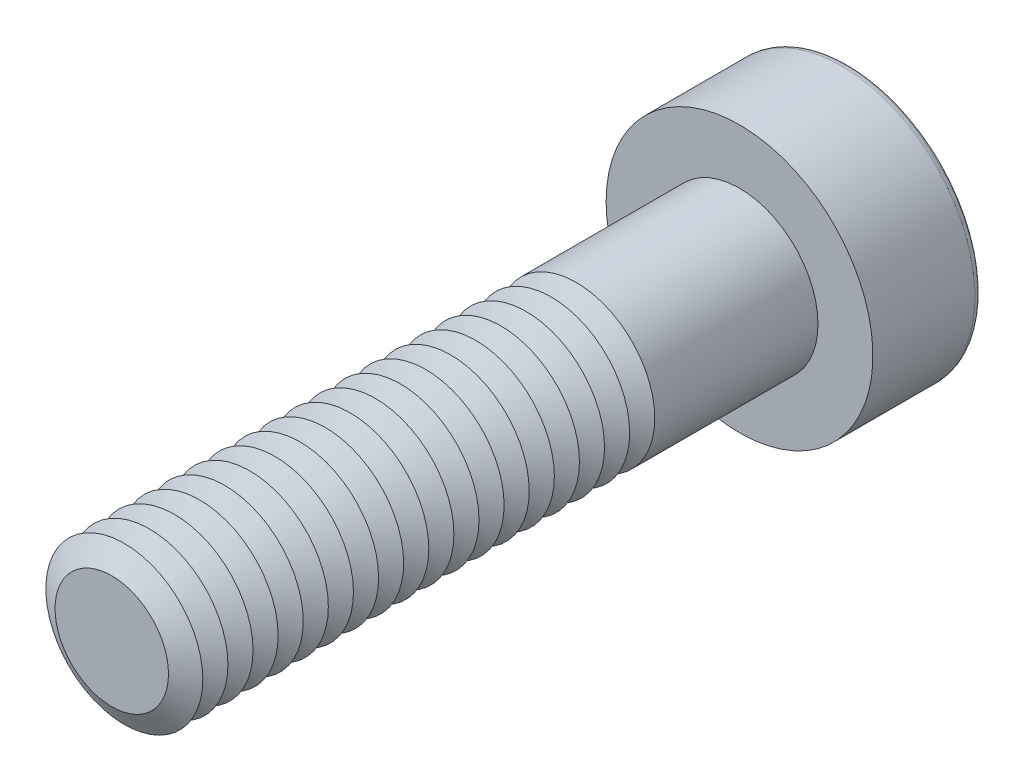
ISO-10303-21;
HEADER;
FILE_DESCRIPTION(('STEP AP214'),'2;1');
FILE_NAME('part.step','',(''),(''),'','','');
FILE_SCHEMA(('AUTOMOTIVE_DESIGN { 1 0 10303 214 1 1 1 1 }'));
ENDSEC;
DATA;
#1=APPLICATION_CONTEXT('core data for automotive mechanical design processes');
#2=APPLICATION_PROTOCOL_DEFINITION('international standard','automotive_design',2000,#1);
#3=PRODUCT_CONTEXT('',#1,'mechanical');
#4=PRODUCT('Part','Part','',(#3));
#5=PRODUCT_RELATED_PRODUCT_CATEGORY('part','',(#4));
#6=PRODUCT_DEFINITION_FORMATION('','',#4);
#7=PRODUCT_DEFINITION_CONTEXT('part definition',#1,'design');
#8=PRODUCT_DEFINITION('design','',#6,#7);
#9=PRODUCT_DEFINITION_SHAPE('','',#8);
#10=(LENGTH_UNIT() NAMED_UNIT(*) SI_UNIT(.MILLI.,.METRE.));
#11=(NAMED_UNIT(*) PLANE_ANGLE_UNIT() SI_UNIT($,.RADIAN.));
#12=(NAMED_UNIT(*) SI_UNIT($,.STERADIAN.) SOLID_ANGLE_UNIT());
#13=UNCERTAINTY_MEASURE_WITH_UNIT(LENGTH_MEASURE(1.E-05),#10,'distance_accuracy_value','');
#14=(GEOMETRIC_REPRESENTATION_CONTEXT(3) GLOBAL_UNCERTAINTY_ASSIGNED_CONTEXT((#13)) GLOBAL_UNIT_ASSIGNED_CONTEXT((#10,
#11,#12)) REPRESENTATION_CONTEXT('',''));
#15=CARTESIAN_POINT('',(0.,0.,0.));
#16=DIRECTION('',(0.,0.,1.));
#17=DIRECTION('',(1.,0.,0.));
#18=AXIS2_PLACEMENT_3D('',#15,#16,#17);
#19=CARTESIAN_POINT('',(0.,0.,17.2));
#20=DIRECTION('',(0.,0.,1.));
#21=DIRECTION('',(1.,0.,0.));
#22=AXIS2_PLACEMENT_3D('',#19,#20,#21);
#23=CONICAL_SURFACE('',#22,2.5,1.0471975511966);
#24=CARTESIAN_POINT('',(0.,0.,16.8));
#25=DIRECTION('',(0.,0.,1.));
#26=DIRECTION('',(1.,0.,0.));
#27=AXIS2_PLACEMENT_3D('',#24,#25,#26);
#28=CIRCLE('',#27,1.80717967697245);
#29=CARTESIAN_POINT('',(1.80717967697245,0.,16.8));
#30=VERTEX_POINT('',#29);
#31=EDGE_CURVE('E313',#30,#30,#28,.T.);
#32=ORIENTED_EDGE('',*,*,#31,.T.);
#33=EDGE_LOOP('',(#32));
#34=FACE_BOUND('',#33,.T.);
#35=CARTESIAN_POINT('',(0.,0.,17.2));
#36=DIRECTION('',(0.,0.,1.));
#37=DIRECTION('',(1.,0.,0.));
#38=AXIS2_PLACEMENT_3D('',#35,#36,#37);
#39=CIRCLE('',#38,2.5);
#40=CARTESIAN_POINT('',(2.5,0.,17.2));
#41=VERTEX_POINT('',#40);
#42=EDGE_CURVE('E315',#41,#41,#39,.T.);
#43=ORIENTED_EDGE('',*,*,#42,.F.);
#44=EDGE_LOOP('',(#43));
#45=FACE_BOUND('',#44,.T.);
#46=ADVANCED_FACE('F39',(#34,#45),#23,.T.);
#47=CARTESIAN_POINT('',(0.,0.,16.8));
#48=DIRECTION('',(0.,0.,-1.));
#49=DIRECTION('',(-1.,0.,0.));
#50=AXIS2_PLACEMENT_3D('',#47,#48,#49);
#51=CONICAL_SURFACE('',#50,1.80717967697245,1.0471975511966);
#52=CARTESIAN_POINT('',(0.,0.,16.4));
#53=DIRECTION('',(0.,0.,1.));
#54=DIRECTION('',(1.,0.,0.));
#55=AXIS2_PLACEMENT_3D('',#52,#53,#54);
#56=CIRCLE('',#55,2.5);
#57=CARTESIAN_POINT('',(2.5,0.,16.4));
#58=VERTEX_POINT('',#57);
#59=EDGE_CURVE('E323',#58,#58,#56,.T.);
#60=ORIENTED_EDGE('',*,*,#59,.T.);
#61=EDGE_LOOP('',(#60));
#62=FACE_BOUND('',#61,.T.);
#63=ORIENTED_EDGE('',*,*,#31,.F.);
#64=EDGE_LOOP('',(#63));
#65=FACE_BOUND('',#64,.T.);
#66=ADVANCED_FACE('F245',(#62,#65),#51,.T.);
#67=CARTESIAN_POINT('',(0.,0.,20.));
#68=DIRECTION('',(0.,0.,1.));
#69=DIRECTION('',(1.,0.,0.));
#70=AXIS2_PLACEMENT_3D('',#67,#68,#69);
#71=PLANE('',#70);
#72=CARTESIAN_POINT('',(0.,0.,20.));
#73=DIRECTION('',(0.,0.,1.));
#74=DIRECTION('',(1.,0.,0.));
#75=AXIS2_PLACEMENT_3D('',#72,#73,#74);
#76=CIRCLE('',#75,1.80717967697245);
#77=CARTESIAN_POINT('',(1.80717967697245,0.,20.));
#78=VERTEX_POINT('',#77);
#79=EDGE_CURVE('E174',#78,#78,#76,.T.);
#80=ORIENTED_EDGE('',*,*,#79,.T.);
#81=EDGE_LOOP('',(#80));
#82=FACE_BOUND('',#81,.T.);
#83=ADVANCED_FACE('F251',(#82),#71,.T.);
#84=CARTESIAN_POINT('',(0.,0.,20.));
#85=DIRECTION('',(0.,0.,-1.));
#86=DIRECTION('',(-1.,0.,0.));
#87=AXIS2_PLACEMENT_3D('',#84,#85,#86);
#88=CONICAL_SURFACE('',#87,1.80717967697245,1.0471975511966);
#89=CARTESIAN_POINT('',(0.,0.,19.6));
#90=DIRECTION('',(0.,0.,1.));
#91=DIRECTION('',(1.,0.,0.));
#92=AXIS2_PLACEMENT_3D('',#89,#90,#91);
#93=CIRCLE('',#92,2.5);
#94=CARTESIAN_POINT('',(2.5,0.,19.6));
#95=VERTEX_POINT('',#94);
#96=EDGE_CURVE('E291',#95,#95,#93,.T.);
#97=ORIENTED_EDGE('',*,*,#96,.T.);
#98=EDGE_LOOP('',(#97));
#99=FACE_BOUND('',#98,.T.);
#100=ORIENTED_EDGE('',*,*,#79,.F.);
#101=EDGE_LOOP('',(#100));
#102=FACE_BOUND('',#101,.T.);
#103=ADVANCED_FACE('F199',(#99,#102),#88,.T.);
#104=CARTESIAN_POINT('',(0.,0.,19.6));
#105=DIRECTION('',(0.,0.,1.));
#106=DIRECTION('',(1.,0.,0.));
#107=AXIS2_PLACEMENT_3D('',#104,#105,#106);
#108=CONICAL_SURFACE('',#107,2.5,1.0471975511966);
#109=CARTESIAN_POINT('',(0.,0.,19.2));
#110=DIRECTION('',(0.,0.,1.));
#111=DIRECTION('',(1.,0.,0.));
#112=AXIS2_PLACEMENT_3D('',#109,#110,#111);
#113=CIRCLE('',#112,1.80717967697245);
#114=CARTESIAN_POINT('',(1.80717967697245,0.,19.2));
#115=VERTEX_POINT('',#114);
#116=EDGE_CURVE('E288',#115,#115,#113,.T.);
#117=ORIENTED_EDGE('',*,*,#116,.T.);
#118=EDGE_LOOP('',(#117));
#119=FACE_BOUND('',#118,.T.);
#120=ORIENTED_EDGE('',*,*,#96,.F.);
#121=EDGE_LOOP('',(#120));
#122=FACE_BOUND('',#121,.T.);
#123=ADVANCED_FACE('F277',(#119,#122),#108,.T.);
#124=CARTESIAN_POINT('',(0.,0.,19.2));
#125=DIRECTION('',(0.,0.,-1.));
#126=DIRECTION('',(-1.,0.,0.));
#127=AXIS2_PLACEMENT_3D('',#124,#125,#126);
#128=CONICAL_SURFACE('',#127,1.80717967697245,1.0471975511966);
#129=CARTESIAN_POINT('',(0.,0.,18.8));
#130=DIRECTION('',(0.,0.,1.));
#131=DIRECTION('',(1.,0.,0.));
#132=AXIS2_PLACEMENT_3D('',#129,#130,#131);
#133=CIRCLE('',#132,2.5);
#134=CARTESIAN_POINT('',(2.5,0.,18.8));
#135=VERTEX_POINT('',#134);
#136=EDGE_CURVE('E299',#135,#135,#133,.T.);
#137=ORIENTED_EDGE('',*,*,#136,.T.);
#138=EDGE_LOOP('',(#137));
#139=FACE_BOUND('',#138,.T.);
#140=ORIENTED_EDGE('',*,*,#116,.F.);
#141=EDGE_LOOP('',(#140));
#142=FACE_BOUND('',#141,.T.);
#143=ADVANCED_FACE('F274',(#139,#142),#128,.T.);
#144=CARTESIAN_POINT('',(0.,0.,18.8));
#145=DIRECTION('',(0.,0.,1.));
#146=DIRECTION('',(1.,0.,0.));
#147=AXIS2_PLACEMENT_3D('',#144,#145,#146);
#148=CONICAL_SURFACE('',#147,2.5,1.0471975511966);
#149=CARTESIAN_POINT('',(0.,0.,18.4));
#150=DIRECTION('',(0.,0.,1.));
#151=DIRECTION('',(1.,0.,0.));
#152=AXIS2_PLACEMENT_3D('',#149,#150,#151);
#153=CIRCLE('',#152,1.80717967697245);
#154=CARTESIAN_POINT('',(1.80717967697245,0.,18.4));
#155=VERTEX_POINT('',#154);
#156=EDGE_CURVE('E293',#155,#155,#153,.T.);
#157=ORIENTED_EDGE('',*,*,#156,.T.);
#158=EDGE_LOOP('',(#157));
#159=FACE_BOUND('',#158,.T.);
#160=ORIENTED_EDGE('',*,*,#136,.F.);
#161=EDGE_LOOP('',(#160));
#162=FACE_BOUND('',#161,.T.);
#163=ADVANCED_FACE('F270',(#159,#162),#148,.T.);
#164=CARTESIAN_POINT('',(0.,0.,18.4));
#165=DIRECTION('',(0.,0.,-1.));
#166=DIRECTION('',(-1.,0.,0.));
#167=AXIS2_PLACEMENT_3D('',#164,#165,#166);
#168=CONICAL_SURFACE('',#167,1.80717967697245,1.0471975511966);
#169=CARTESIAN_POINT('',(0.,0.,18.));
#170=DIRECTION('',(0.,0.,1.));
#171=DIRECTION('',(1.,0.,0.));
#172=AXIS2_PLACEMENT_3D('',#169,#170,#171);
#173=CIRCLE('',#172,2.5);
#174=CARTESIAN_POINT('',(2.5,0.,18.));
#175=VERTEX_POINT('',#174);
#176=EDGE_CURVE('E309',#175,#175,#173,.T.);
#177=ORIENTED_EDGE('',*,*,#176,.T.);
#178=EDGE_LOOP('',(#177));
#179=FACE_BOUND('',#178,.T.);
#180=ORIENTED_EDGE('',*,*,#156,.F.);
#181=EDGE_LOOP('',(#180));
#182=FACE_BOUND('',#181,.T.);
#183=ADVANCED_FACE('F266',(#179,#182),#168,.T.);
#184=CARTESIAN_POINT('',(0.,0.,18.));
#185=DIRECTION('',(0.,0.,1.));
#186=DIRECTION('',(1.,0.,0.));
#187=AXIS2_PLACEMENT_3D('',#184,#185,#186);
#188=CONICAL_SURFACE('',#187,2.5,1.0471975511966);
#189=CARTESIAN_POINT('',(0.,0.,17.6));
#190=DIRECTION('',(0.,0.,1.));
#191=DIRECTION('',(1.,0.,0.));
#192=AXIS2_PLACEMENT_3D('',#189,#190,#191);
#193=CIRCLE('',#192,1.80717967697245);
#194=CARTESIAN_POINT('',(1.80717967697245,0.,17.6));
#195=VERTEX_POINT('',#194);
#196=EDGE_CURVE('E305',#195,#195,#193,.T.);
#197=ORIENTED_EDGE('',*,*,#196,.T.);
#198=EDGE_LOOP('',(#197));
#199=FACE_BOUND('',#198,.T.);
#200=ORIENTED_EDGE('',*,*,#176,.F.);
#201=EDGE_LOOP('',(#200));
#202=FACE_BOUND('',#201,.T.);
#203=ADVANCED_FACE('F262',(#199,#202),#188,.T.);
#204=CARTESIAN_POINT('',(0.,0.,17.6));
#205=DIRECTION('',(0.,0.,-1.));
#206=DIRECTION('',(-1.,0.,0.));
#207=AXIS2_PLACEMENT_3D('',#204,#205,#206);
#208=CONICAL_SURFACE('',#207,1.80717967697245,1.0471975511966);
#209=ORIENTED_EDGE('',*,*,#42,.T.);
#210=EDGE_LOOP('',(#209));
#211=FACE_BOUND('',#210,.T.);
#212=ORIENTED_EDGE('',*,*,#196,.F.);
#213=EDGE_LOOP('',(#212));
#214=FACE_BOUND('',#213,.T.);
#215=ADVANCED_FACE('F258',(#211,#214),#208,.T.);
#216=CARTESIAN_POINT('',(0.,0.,16.4));
#217=DIRECTION('',(0.,0.,1.));
#218=DIRECTION('',(1.,0.,0.));
#219=AXIS2_PLACEMENT_3D('',#216,#217,#218);
#220=CONICAL_SURFACE('',#219,2.5,1.0471975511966);
#221=CARTESIAN_POINT('',(0.,0.,16.));
#222=DIRECTION('',(0.,0.,1.));
#223=DIRECTION('',(1.,0.,0.));
#224=AXIS2_PLACEMENT_3D('',#221,#222,#223);
#225=CIRCLE('',#224,1.80717967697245);
#226=CARTESIAN_POINT('',(1.80717967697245,0.,16.));
#227=VERTEX_POINT('',#226);
#228=EDGE_CURVE('E319',#227,#227,#225,.T.);
#229=ORIENTED_EDGE('',*,*,#228,.T.);
#230=EDGE_LOOP('',(#229));
#231=FACE_BOUND('',#230,.T.);
#232=ORIENTED_EDGE('',*,*,#59,.F.);
#233=EDGE_LOOP('',(#232));
#234=FACE_BOUND('',#233,.T.);
#235=ADVANCED_FACE('F261',(#231,#234),#220,.T.);
#236=CARTESIAN_POINT('',(0.,0.,16.));
#237=DIRECTION('',(0.,0.,-1.));
#238=DIRECTION('',(-1.,0.,0.));
#239=AXIS2_PLACEMENT_3D('',#236,#237,#238);
#240=CONICAL_SURFACE('',#239,1.80717967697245,1.0471975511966);
#241=CARTESIAN_POINT('',(0.,0.,15.6));
#242=DIRECTION('',(0.,0.,1.));
#243=DIRECTION('',(1.,0.,0.));
#244=AXIS2_PLACEMENT_3D('',#241,#242,#243);
#245=CIRCLE('',#244,2.5);
#246=CARTESIAN_POINT('',(2.5,0.,15.6));
#247=VERTEX_POINT('',#246);
#248=EDGE_CURVE('E331',#247,#247,#245,.T.);
#249=ORIENTED_EDGE('',*,*,#248,.T.);
#250=EDGE_LOOP('',(#249));
#251=FACE_BOUND('',#250,.T.);
#252=ORIENTED_EDGE('',*,*,#228,.F.);
#253=EDGE_LOOP('',(#252));
#254=FACE_BOUND('',#253,.T.);
#255=ADVANCED_FACE('F544',(#251,#254),#240,.T.);
#256=CARTESIAN_POINT('',(0.,0.,15.6));
#257=DIRECTION('',(0.,0.,1.));
#258=DIRECTION('',(1.,0.,0.));
#259=AXIS2_PLACEMENT_3D('',#256,#257,#258);
#260=CONICAL_SURFACE('',#259,2.5,1.0471975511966);
#261=CARTESIAN_POINT('',(0.,0.,15.2));
#262=DIRECTION('',(0.,0.,1.));
#263=DIRECTION('',(1.,0.,0.));
#264=AXIS2_PLACEMENT_3D('',#261,#262,#263);
#265=CIRCLE('',#264,1.80717967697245);
#266=CARTESIAN_POINT('',(1.80717967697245,0.,15.2));
#267=VERTEX_POINT('',#266);
#268=EDGE_CURVE('E327',#267,#267,#265,.T.);
#269=ORIENTED_EDGE('',*,*,#268,.T.);
#270=EDGE_LOOP('',(#269));
#271=FACE_BOUND('',#270,.T.);
#272=ORIENTED_EDGE('',*,*,#248,.F.);
#273=EDGE_LOOP('',(#272));
#274=FACE_BOUND('',#273,.T.);
#275=ADVANCED_FACE('F540',(#271,#274),#260,.T.);
#276=CARTESIAN_POINT('',(0.,0.,15.2));
#277=DIRECTION('',(0.,0.,-1.));
#278=DIRECTION('',(-1.,0.,0.));
#279=AXIS2_PLACEMENT_3D('',#276,#277,#278);
#280=CONICAL_SURFACE('',#279,1.80717967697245,1.0471975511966);
#281=CARTESIAN_POINT('',(0.,0.,14.8));
#282=DIRECTION('',(0.,0.,1.));
#283=DIRECTION('',(1.,0.,0.));
#284=AXIS2_PLACEMENT_3D('',#281,#282,#283);
#285=CIRCLE('',#284,2.5);
#286=CARTESIAN_POINT('',(2.5,0.,14.8));
#287=VERTEX_POINT('',#286);
#288=EDGE_CURVE('E339',#287,#287,#285,.T.);
#289=ORIENTED_EDGE('',*,*,#288,.T.);
#290=EDGE_LOOP('',(#289));
#291=FACE_BOUND('',#290,.T.);
#292=ORIENTED_EDGE('',*,*,#268,.F.);
#293=EDGE_LOOP('',(#292));
#294=FACE_BOUND('',#293,.T.);
#295=ADVANCED_FACE('F536',(#291,#294),#280,.T.);
#296=CARTESIAN_POINT('',(0.,0.,14.8));
#297=DIRECTION('',(0.,0.,1.));
#298=DIRECTION('',(1.,0.,0.));
#299=AXIS2_PLACEMENT_3D('',#296,#297,#298);
#300=CONICAL_SURFACE('',#299,2.5,1.0471975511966);
#301=CARTESIAN_POINT('',(0.,0.,14.4));
#302=DIRECTION('',(0.,0.,1.));
#303=DIRECTION('',(1.,0.,0.));
#304=AXIS2_PLACEMENT_3D('',#301,#302,#303);
#305=CIRCLE('',#304,1.80717967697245);
#306=CARTESIAN_POINT('',(1.80717967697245,0.,14.4));
#307=VERTEX_POINT('',#306);
#308=EDGE_CURVE('E335',#307,#307,#305,.T.);
#309=ORIENTED_EDGE('',*,*,#308,.T.);
#310=EDGE_LOOP('',(#309));
#311=FACE_BOUND('',#310,.T.);
#312=ORIENTED_EDGE('',*,*,#288,.F.);
#313=EDGE_LOOP('',(#312));
#314=FACE_BOUND('',#313,.T.);
#315=ADVANCED_FACE('F532',(#311,#314),#300,.T.);
#316=CARTESIAN_POINT('',(0.,0.,14.4));
#317=DIRECTION('',(0.,0.,-1.));
#318=DIRECTION('',(-1.,0.,0.));
#319=AXIS2_PLACEMENT_3D('',#316,#317,#318);
#320=CONICAL_SURFACE('',#319,1.80717967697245,1.0471975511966);
#321=CARTESIAN_POINT('',(0.,0.,14.));
#322=DIRECTION('',(0.,0.,1.));
#323=DIRECTION('',(1.,0.,0.));
#324=AXIS2_PLACEMENT_3D('',#321,#322,#323);
#325=CIRCLE('',#324,2.5);
#326=CARTESIAN_POINT('',(2.5,0.,14.));
#327=VERTEX_POINT('',#326);
#328=EDGE_CURVE('E347',#327,#327,#325,.T.);
#329=ORIENTED_EDGE('',*,*,#328,.T.);
#330=EDGE_LOOP('',(#329));
#331=FACE_BOUND('',#330,.T.);
#332=ORIENTED_EDGE('',*,*,#308,.F.);
#333=EDGE_LOOP('',(#332));
#334=FACE_BOUND('',#333,.T.);
#335=ADVANCED_FACE('F528',(#331,#334),#320,.T.);
#336=CARTESIAN_POINT('',(0.,0.,14.));
#337=DIRECTION('',(0.,0.,1.));
#338=DIRECTION('',(1.,0.,0.));
#339=AXIS2_PLACEMENT_3D('',#336,#337,#338);
#340=CONICAL_SURFACE('',#339,2.5,1.0471975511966);
#341=CARTESIAN_POINT('',(0.,0.,13.6));
#342=DIRECTION('',(0.,0.,1.));
#343=DIRECTION('',(1.,0.,0.));
#344=AXIS2_PLACEMENT_3D('',#341,#342,#343);
#345=CIRCLE('',#344,1.80717967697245);
#346=CARTESIAN_POINT('',(1.80717967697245,0.,13.6));
#347=VERTEX_POINT('',#346);
#348=EDGE_CURVE('E343',#347,#347,#345,.T.);
#349=ORIENTED_EDGE('',*,*,#348,.T.);
#350=EDGE_LOOP('',(#349));
#351=FACE_BOUND('',#350,.T.);
#352=ORIENTED_EDGE('',*,*,#328,.F.);
#353=EDGE_LOOP('',(#352));
#354=FACE_BOUND('',#353,.T.);
#355=ADVANCED_FACE('F524',(#351,#354),#340,.T.);
#356=CARTESIAN_POINT('',(0.,0.,13.6));
#357=DIRECTION('',(0.,0.,-1.));
#358=DIRECTION('',(-1.,0.,0.));
#359=AXIS2_PLACEMENT_3D('',#356,#357,#358);
#360=CONICAL_SURFACE('',#359,1.80717967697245,1.0471975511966);
#361=CARTESIAN_POINT('',(0.,0.,13.2));
#362=DIRECTION('',(0.,0.,1.));
#363=DIRECTION('',(1.,0.,0.));
#364=AXIS2_PLACEMENT_3D('',#361,#362,#363);
#365=CIRCLE('',#364,2.5);
#366=CARTESIAN_POINT('',(2.5,0.,13.2));
#367=VERTEX_POINT('',#366);
#368=EDGE_CURVE('E355',#367,#367,#365,.T.);
#369=ORIENTED_EDGE('',*,*,#368,.T.);
#370=EDGE_LOOP('',(#369));
#371=FACE_BOUND('',#370,.T.);
#372=ORIENTED_EDGE('',*,*,#348,.F.);
#373=EDGE_LOOP('',(#372));
#374=FACE_BOUND('',#373,.T.);
#375=ADVANCED_FACE('F520',(#371,#374),#360,.T.);
#376=CARTESIAN_POINT('',(0.,0.,13.2));
#377=DIRECTION('',(0.,0.,1.));
#378=DIRECTION('',(1.,0.,0.));
#379=AXIS2_PLACEMENT_3D('',#376,#377,#378);
#380=CONICAL_SURFACE('',#379,2.5,1.0471975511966);
#381=CARTESIAN_POINT('',(0.,0.,12.8));
#382=DIRECTION('',(0.,0.,1.));
#383=DIRECTION('',(1.,0.,0.));
#384=AXIS2_PLACEMENT_3D('',#381,#382,#383);
#385=CIRCLE('',#384,1.80717967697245);
#386=CARTESIAN_POINT('',(1.80717967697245,0.,12.8));
#387=VERTEX_POINT('',#386);
#388=EDGE_CURVE('E351',#387,#387,#385,.T.);
#389=ORIENTED_EDGE('',*,*,#388,.T.);
#390=EDGE_LOOP('',(#389));
#391=FACE_BOUND('',#390,.T.);
#392=ORIENTED_EDGE('',*,*,#368,.F.);
#393=EDGE_LOOP('',(#392));
#394=FACE_BOUND('',#393,.T.);
#395=ADVANCED_FACE('F516',(#391,#394),#380,.T.);
#396=CARTESIAN_POINT('',(0.,0.,12.8));
#397=DIRECTION('',(0.,0.,-1.));
#398=DIRECTION('',(-1.,0.,0.));
#399=AXIS2_PLACEMENT_3D('',#396,#397,#398);
#400=CONICAL_SURFACE('',#399,1.80717967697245,1.0471975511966);
#401=CARTESIAN_POINT('',(0.,0.,12.4));
#402=DIRECTION('',(0.,0.,1.));
#403=DIRECTION('',(1.,0.,0.));
#404=AXIS2_PLACEMENT_3D('',#401,#402,#403);
#405=CIRCLE('',#404,2.5);
#406=CARTESIAN_POINT('',(2.5,0.,12.4));
#407=VERTEX_POINT('',#406);
#408=EDGE_CURVE('E363',#407,#407,#405,.T.);
#409=ORIENTED_EDGE('',*,*,#408,.T.);
#410=EDGE_LOOP('',(#409));
#411=FACE_BOUND('',#410,.T.);
#412=ORIENTED_EDGE('',*,*,#388,.F.);
#413=EDGE_LOOP('',(#412));
#414=FACE_BOUND('',#413,.T.);
#415=ADVANCED_FACE('F512',(#411,#414),#400,.T.);
#416=CARTESIAN_POINT('',(0.,0.,12.4));
#417=DIRECTION('',(0.,0.,1.));
#418=DIRECTION('',(1.,0.,0.));
#419=AXIS2_PLACEMENT_3D('',#416,#417,#418);
#420=CONICAL_SURFACE('',#419,2.5,1.0471975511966);
#421=CARTESIAN_POINT('',(0.,0.,12.));
#422=DIRECTION('',(0.,0.,1.));
#423=DIRECTION('',(1.,0.,0.));
#424=AXIS2_PLACEMENT_3D('',#421,#422,#423);
#425=CIRCLE('',#424,1.80717967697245);
#426=CARTESIAN_POINT('',(1.80717967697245,0.,12.));
#427=VERTEX_POINT('',#426);
#428=EDGE_CURVE('E359',#427,#427,#425,.T.);
#429=ORIENTED_EDGE('',*,*,#428,.T.);
#430=EDGE_LOOP('',(#429));
#431=FACE_BOUND('',#430,.T.);
#432=ORIENTED_EDGE('',*,*,#408,.F.);
#433=EDGE_LOOP('',(#432));
#434=FACE_BOUND('',#433,.T.);
#435=ADVANCED_FACE('F508',(#431,#434),#420,.T.);
#436=CARTESIAN_POINT('',(0.,0.,12.));
#437=DIRECTION('',(0.,0.,-1.));
#438=DIRECTION('',(-1.,0.,0.));
#439=AXIS2_PLACEMENT_3D('',#436,#437,#438);
#440=CONICAL_SURFACE('',#439,1.80717967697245,1.0471975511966);
#441=CARTESIAN_POINT('',(0.,0.,11.6));
#442=DIRECTION('',(0.,0.,1.));
#443=DIRECTION('',(1.,0.,0.));
#444=AXIS2_PLACEMENT_3D('',#441,#442,#443);
#445=CIRCLE('',#444,2.5);
#446=CARTESIAN_POINT('',(2.5,0.,11.6));
#447=VERTEX_POINT('',#446);
#448=EDGE_CURVE('E371',#447,#447,#445,.T.);
#449=ORIENTED_EDGE('',*,*,#448,.T.);
#450=EDGE_LOOP('',(#449));
#451=FACE_BOUND('',#450,.T.);
#452=ORIENTED_EDGE('',*,*,#428,.F.);
#453=EDGE_LOOP('',(#452));
#454=FACE_BOUND('',#453,.T.);
#455=ADVANCED_FACE('F504',(#451,#454),#440,.T.);
#456=CARTESIAN_POINT('',(0.,0.,11.6));
#457=DIRECTION('',(0.,0.,1.));
#458=DIRECTION('',(1.,0.,0.));
#459=AXIS2_PLACEMENT_3D('',#456,#457,#458);
#460=CONICAL_SURFACE('',#459,2.5,1.0471975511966);
#461=CARTESIAN_POINT('',(0.,0.,11.2));
#462=DIRECTION('',(0.,0.,1.));
#463=DIRECTION('',(1.,0.,0.));
#464=AXIS2_PLACEMENT_3D('',#461,#462,#463);
#465=CIRCLE('',#464,1.80717967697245);
#466=CARTESIAN_POINT('',(1.80717967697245,0.,11.2));
#467=VERTEX_POINT('',#466);
#468=EDGE_CURVE('E367',#467,#467,#465,.T.);
#469=ORIENTED_EDGE('',*,*,#468,.T.);
#470=EDGE_LOOP('',(#469));
#471=FACE_BOUND('',#470,.T.);
#472=ORIENTED_EDGE('',*,*,#448,.F.);
#473=EDGE_LOOP('',(#472));
#474=FACE_BOUND('',#473,.T.);
#475=ADVANCED_FACE('F500',(#471,#474),#460,.T.);
#476=CARTESIAN_POINT('',(0.,0.,11.2));
#477=DIRECTION('',(0.,0.,-1.));
#478=DIRECTION('',(-1.,0.,0.));
#479=AXIS2_PLACEMENT_3D('',#476,#477,#478);
#480=CONICAL_SURFACE('',#479,1.80717967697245,1.0471975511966);
#481=CARTESIAN_POINT('',(0.,0.,10.8));
#482=DIRECTION('',(0.,0.,1.));
#483=DIRECTION('',(1.,0.,0.));
#484=AXIS2_PLACEMENT_3D('',#481,#482,#483);
#485=CIRCLE('',#484,2.5);
#486=CARTESIAN_POINT('',(2.5,0.,10.8));
#487=VERTEX_POINT('',#486);
#488=EDGE_CURVE('E379',#487,#487,#485,.T.);
#489=ORIENTED_EDGE('',*,*,#488,.T.);
#490=EDGE_LOOP('',(#489));
#491=FACE_BOUND('',#490,.T.);
#492=ORIENTED_EDGE('',*,*,#468,.F.);
#493=EDGE_LOOP('',(#492));
#494=FACE_BOUND('',#493,.T.);
#495=ADVANCED_FACE('F496',(#491,#494),#480,.T.);
#496=CARTESIAN_POINT('',(0.,0.,10.8));
#497=DIRECTION('',(0.,0.,1.));
#498=DIRECTION('',(1.,0.,0.));
#499=AXIS2_PLACEMENT_3D('',#496,#497,#498);
#500=CONICAL_SURFACE('',#499,2.5,1.0471975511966);
#501=CARTESIAN_POINT('',(0.,0.,10.4));
#502=DIRECTION('',(0.,0.,1.));
#503=DIRECTION('',(1.,0.,0.));
#504=AXIS2_PLACEMENT_3D('',#501,#502,#503);
#505=CIRCLE('',#504,1.80717967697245);
#506=CARTESIAN_POINT('',(1.80717967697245,0.,10.4));
#507=VERTEX_POINT('',#506);
#508=EDGE_CURVE('E375',#507,#507,#505,.T.);
#509=ORIENTED_EDGE('',*,*,#508,.T.);
#510=EDGE_LOOP('',(#509));
#511=FACE_BOUND('',#510,.T.);
#512=ORIENTED_EDGE('',*,*,#488,.F.);
#513=EDGE_LOOP('',(#512));
#514=FACE_BOUND('',#513,.T.);
#515=ADVANCED_FACE('F492',(#511,#514),#500,.T.);
#516=CARTESIAN_POINT('',(0.,0.,10.4));
#517=DIRECTION('',(0.,0.,-1.));
#518=DIRECTION('',(-1.,0.,0.));
#519=AXIS2_PLACEMENT_3D('',#516,#517,#518);
#520=CONICAL_SURFACE('',#519,1.80717967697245,1.0471975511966);
#521=CARTESIAN_POINT('',(0.,0.,10.));
#522=DIRECTION('',(0.,0.,1.));
#523=DIRECTION('',(1.,0.,0.));
#524=AXIS2_PLACEMENT_3D('',#521,#522,#523);
#525=CIRCLE('',#524,2.5);
#526=CARTESIAN_POINT('',(2.5,0.,10.));
#527=VERTEX_POINT('',#526);
#528=EDGE_CURVE('E387',#527,#527,#525,.T.);
#529=ORIENTED_EDGE('',*,*,#528,.T.);
#530=EDGE_LOOP('',(#529));
#531=FACE_BOUND('',#530,.T.);
#532=ORIENTED_EDGE('',*,*,#508,.F.);
#533=EDGE_LOOP('',(#532));
#534=FACE_BOUND('',#533,.T.);
#535=ADVANCED_FACE('F488',(#531,#534),#520,.T.);
#536=CARTESIAN_POINT('',(0.,0.,10.));
#537=DIRECTION('',(0.,0.,1.));
#538=DIRECTION('',(1.,0.,0.));
#539=AXIS2_PLACEMENT_3D('',#536,#537,#538);
#540=CONICAL_SURFACE('',#539,2.5,1.0471975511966);
#541=CARTESIAN_POINT('',(0.,0.,9.6));
#542=DIRECTION('',(0.,0.,1.));
#543=DIRECTION('',(1.,0.,0.));
#544=AXIS2_PLACEMENT_3D('',#541,#542,#543);
#545=CIRCLE('',#544,1.80717967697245);
#546=CARTESIAN_POINT('',(1.80717967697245,0.,9.6));
#547=VERTEX_POINT('',#546);
#548=EDGE_CURVE('E383',#547,#547,#545,.T.);
#549=ORIENTED_EDGE('',*,*,#548,.T.);
#550=EDGE_LOOP('',(#549));
#551=FACE_BOUND('',#550,.T.);
#552=ORIENTED_EDGE('',*,*,#528,.F.);
#553=EDGE_LOOP('',(#552));
#554=FACE_BOUND('',#553,.T.);
#555=ADVANCED_FACE('F484',(#551,#554),#540,.T.);
#556=CARTESIAN_POINT('',(0.,0.,9.6));
#557=DIRECTION('',(0.,0.,-1.));
#558=DIRECTION('',(-1.,0.,0.));
#559=AXIS2_PLACEMENT_3D('',#556,#557,#558);
#560=CONICAL_SURFACE('',#559,1.80717967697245,1.0471975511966);
#561=CARTESIAN_POINT('',(0.,0.,9.2));
#562=DIRECTION('',(0.,0.,1.));
#563=DIRECTION('',(1.,0.,0.));
#564=AXIS2_PLACEMENT_3D('',#561,#562,#563);
#565=CIRCLE('',#564,2.5);
#566=CARTESIAN_POINT('',(2.5,0.,9.2));
#567=VERTEX_POINT('',#566);
#568=EDGE_CURVE('E395',#567,#567,#565,.T.);
#569=ORIENTED_EDGE('',*,*,#568,.T.);
#570=EDGE_LOOP('',(#569));
#571=FACE_BOUND('',#570,.T.);
#572=ORIENTED_EDGE('',*,*,#548,.F.);
#573=EDGE_LOOP('',(#572));
#574=FACE_BOUND('',#573,.T.);
#575=ADVANCED_FACE('F480',(#571,#574),#560,.T.);
#576=CARTESIAN_POINT('',(0.,0.,9.2));
#577=DIRECTION('',(0.,0.,1.));
#578=DIRECTION('',(1.,0.,0.));
#579=AXIS2_PLACEMENT_3D('',#576,#577,#578);
#580=CONICAL_SURFACE('',#579,2.5,1.0471975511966);
#581=CARTESIAN_POINT('',(0.,0.,8.8));
#582=DIRECTION('',(0.,0.,1.));
#583=DIRECTION('',(1.,0.,0.));
#584=AXIS2_PLACEMENT_3D('',#581,#582,#583);
#585=CIRCLE('',#584,1.80717967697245);
#586=CARTESIAN_POINT('',(1.80717967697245,0.,8.8));
#587=VERTEX_POINT('',#586);
#588=EDGE_CURVE('E391',#587,#587,#585,.T.);
#589=ORIENTED_EDGE('',*,*,#588,.T.);
#590=EDGE_LOOP('',(#589));
#591=FACE_BOUND('',#590,.T.);
#592=ORIENTED_EDGE('',*,*,#568,.F.);
#593=EDGE_LOOP('',(#592));
#594=FACE_BOUND('',#593,.T.);
#595=ADVANCED_FACE('F476',(#591,#594),#580,.T.);
#596=CARTESIAN_POINT('',(0.,0.,8.8));
#597=DIRECTION('',(0.,0.,-1.));
#598=DIRECTION('',(-1.,0.,0.));
#599=AXIS2_PLACEMENT_3D('',#596,#597,#598);
#600=CONICAL_SURFACE('',#599,1.80717967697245,1.0471975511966);
#601=CARTESIAN_POINT('',(0.,0.,8.4));
#602=DIRECTION('',(0.,0.,1.));
#603=DIRECTION('',(1.,0.,0.));
#604=AXIS2_PLACEMENT_3D('',#601,#602,#603);
#605=CIRCLE('',#604,2.5);
#606=CARTESIAN_POINT('',(2.5,0.,8.4));
#607=VERTEX_POINT('',#606);
#608=EDGE_CURVE('E403',#607,#607,#605,.T.);
#609=ORIENTED_EDGE('',*,*,#608,.T.);
#610=EDGE_LOOP('',(#609));
#611=FACE_BOUND('',#610,.T.);
#612=ORIENTED_EDGE('',*,*,#588,.F.);
#613=EDGE_LOOP('',(#612));
#614=FACE_BOUND('',#613,.T.);
#615=ADVANCED_FACE('F472',(#611,#614),#600,.T.);
#616=CARTESIAN_POINT('',(0.,0.,8.4));
#617=DIRECTION('',(0.,0.,1.));
#618=DIRECTION('',(1.,0.,0.));
#619=AXIS2_PLACEMENT_3D('',#616,#617,#618);
#620=CONICAL_SURFACE('',#619,2.5,1.0471975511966);
#621=CARTESIAN_POINT('',(0.,0.,8.));
#622=DIRECTION('',(0.,0.,1.));
#623=DIRECTION('',(1.,0.,0.));
#624=AXIS2_PLACEMENT_3D('',#621,#622,#623);
#625=CIRCLE('',#624,1.80717967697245);
#626=CARTESIAN_POINT('',(1.80717967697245,0.,8.));
#627=VERTEX_POINT('',#626);
#628=EDGE_CURVE('E399',#627,#627,#625,.T.);
#629=ORIENTED_EDGE('',*,*,#628,.T.);
#630=EDGE_LOOP('',(#629));
#631=FACE_BOUND('',#630,.T.);
#632=ORIENTED_EDGE('',*,*,#608,.F.);
#633=EDGE_LOOP('',(#632));
#634=FACE_BOUND('',#633,.T.);
#635=ADVANCED_FACE('F468',(#631,#634),#620,.T.);
#636=CARTESIAN_POINT('',(0.,0.,8.));
#637=DIRECTION('',(0.,0.,-1.));
#638=DIRECTION('',(-1.,0.,0.));
#639=AXIS2_PLACEMENT_3D('',#636,#637,#638);
#640=CONICAL_SURFACE('',#639,1.80717967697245,1.0471975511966);
#641=CARTESIAN_POINT('',(0.,0.,7.6));
#642=DIRECTION('',(0.,0.,1.));
#643=DIRECTION('',(1.,0.,0.));
#644=AXIS2_PLACEMENT_3D('',#641,#642,#643);
#645=CIRCLE('',#644,2.5);
#646=CARTESIAN_POINT('',(2.5,0.,7.6));
#647=VERTEX_POINT('',#646);
#648=EDGE_CURVE('E411',#647,#647,#645,.T.);
#649=ORIENTED_EDGE('',*,*,#648,.T.);
#650=EDGE_LOOP('',(#649));
#651=FACE_BOUND('',#650,.T.);
#652=ORIENTED_EDGE('',*,*,#628,.F.);
#653=EDGE_LOOP('',(#652));
#654=FACE_BOUND('',#653,.T.);
#655=ADVANCED_FACE('F464',(#651,#654),#640,.T.);
#656=CARTESIAN_POINT('',(0.,0.,7.6));
#657=DIRECTION('',(0.,0.,1.));
#658=DIRECTION('',(1.,0.,0.));
#659=AXIS2_PLACEMENT_3D('',#656,#657,#658);
#660=CONICAL_SURFACE('',#659,2.5,1.0471975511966);
#661=CARTESIAN_POINT('',(0.,0.,7.2));
#662=DIRECTION('',(0.,0.,1.));
#663=DIRECTION('',(1.,0.,0.));
#664=AXIS2_PLACEMENT_3D('',#661,#662,#663);
#665=CIRCLE('',#664,1.80717967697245);
#666=CARTESIAN_POINT('',(1.80717967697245,0.,7.2));
#667=VERTEX_POINT('',#666);
#668=EDGE_CURVE('E407',#667,#667,#665,.T.);
#669=ORIENTED_EDGE('',*,*,#668,.T.);
#670=EDGE_LOOP('',(#669));
#671=FACE_BOUND('',#670,.T.);
#672=ORIENTED_EDGE('',*,*,#648,.F.);
#673=EDGE_LOOP('',(#672));
#674=FACE_BOUND('',#673,.T.);
#675=ADVANCED_FACE('F460',(#671,#674),#660,.T.);
#676=CARTESIAN_POINT('',(0.,0.,7.2));
#677=DIRECTION('',(0.,0.,-1.));
#678=DIRECTION('',(-1.,0.,0.));
#679=AXIS2_PLACEMENT_3D('',#676,#677,#678);
#680=CONICAL_SURFACE('',#679,1.80717967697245,1.0471975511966);
#681=CARTESIAN_POINT('',(0.,0.,6.8));
#682=DIRECTION('',(0.,0.,1.));
#683=DIRECTION('',(1.,0.,0.));
#684=AXIS2_PLACEMENT_3D('',#681,#682,#683);
#685=CIRCLE('',#684,2.5);
#686=CARTESIAN_POINT('',(2.5,0.,6.8));
#687=VERTEX_POINT('',#686);
#688=EDGE_CURVE('E419',#687,#687,#685,.T.);
#689=ORIENTED_EDGE('',*,*,#688,.T.);
#690=EDGE_LOOP('',(#689));
#691=FACE_BOUND('',#690,.T.);
#692=ORIENTED_EDGE('',*,*,#668,.F.);
#693=EDGE_LOOP('',(#692));
#694=FACE_BOUND('',#693,.T.);
#695=ADVANCED_FACE('F456',(#691,#694),#680,.T.);
#696=CARTESIAN_POINT('',(0.,0.,6.8));
#697=DIRECTION('',(0.,0.,1.));
#698=DIRECTION('',(1.,0.,0.));
#699=AXIS2_PLACEMENT_3D('',#696,#697,#698);
#700=CONICAL_SURFACE('',#699,2.5,1.0471975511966);
#701=CARTESIAN_POINT('',(0.,0.,6.4));
#702=DIRECTION('',(0.,0.,1.));
#703=DIRECTION('',(1.,0.,0.));
#704=AXIS2_PLACEMENT_3D('',#701,#702,#703);
#705=CIRCLE('',#704,1.80717967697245);
#706=CARTESIAN_POINT('',(1.80717967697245,0.,6.4));
#707=VERTEX_POINT('',#706);
#708=EDGE_CURVE('E415',#707,#707,#705,.T.);
#709=ORIENTED_EDGE('',*,*,#708,.T.);
#710=EDGE_LOOP('',(#709));
#711=FACE_BOUND('',#710,.T.);
#712=ORIENTED_EDGE('',*,*,#688,.F.);
#713=EDGE_LOOP('',(#712));
#714=FACE_BOUND('',#713,.T.);
#715=ADVANCED_FACE('F451',(#711,#714),#700,.T.);
#716=CARTESIAN_POINT('',(0.,0.,6.4));
#717=DIRECTION('',(0.,0.,-1.));
#718=DIRECTION('',(-1.,0.,0.));
#719=AXIS2_PLACEMENT_3D('',#716,#717,#718);
#720=CONICAL_SURFACE('',#719,1.80717967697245,1.0471975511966);
#721=CARTESIAN_POINT('',(0.,0.,6.));
#722=DIRECTION('',(0.,0.,1.));
#723=DIRECTION('',(1.,0.,0.));
#724=AXIS2_PLACEMENT_3D('',#721,#722,#723);
#725=CIRCLE('',#724,2.5);
#726=CARTESIAN_POINT('',(2.5,0.,6.));
#727=VERTEX_POINT('',#726);
#728=EDGE_CURVE('E431',#727,#727,#725,.T.);
#729=ORIENTED_EDGE('',*,*,#728,.T.);
#730=EDGE_LOOP('',(#729));
#731=FACE_BOUND('',#730,.T.);
#732=ORIENTED_EDGE('',*,*,#708,.F.);
#733=EDGE_LOOP('',(#732));
#734=FACE_BOUND('',#733,.T.);
#735=ADVANCED_FACE('F437',(#731,#734),#720,.T.);
#736=CARTESIAN_POINT('',(0.,0.,6.));
#737=DIRECTION('',(0.,0.,1.));
#738=DIRECTION('',(1.,0.,0.));
#739=AXIS2_PLACEMENT_3D('',#736,#737,#738);
#740=CONICAL_SURFACE('',#739,2.5,1.0471975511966);
#741=CARTESIAN_POINT('',(0.,0.,5.6));
#742=DIRECTION('',(0.,0.,1.));
#743=DIRECTION('',(1.,0.,0.));
#744=AXIS2_PLACEMENT_3D('',#741,#742,#743);
#745=CIRCLE('',#744,1.80717967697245);
#746=CARTESIAN_POINT('',(1.80717967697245,0.,5.6));
#747=VERTEX_POINT('',#746);
#748=EDGE_CURVE('E423',#747,#747,#745,.T.);
#749=ORIENTED_EDGE('',*,*,#748,.T.);
#750=EDGE_LOOP('',(#749));
#751=FACE_BOUND('',#750,.T.);
#752=ORIENTED_EDGE('',*,*,#728,.F.);
#753=EDGE_LOOP('',(#752));
#754=FACE_BOUND('',#753,.T.);
#755=ADVANCED_FACE('F440',(#751,#754),#740,.T.);
#756=CARTESIAN_POINT('',(0.,0.,5.6));
#757=DIRECTION('',(0.,0.,-1.));
#758=DIRECTION('',(-1.,0.,0.));
#759=AXIS2_PLACEMENT_3D('',#756,#757,#758);
#760=CONICAL_SURFACE('',#759,1.80717967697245,1.0471975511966);
#761=CARTESIAN_POINT('',(0.,0.,5.2));
#762=DIRECTION('',(0.,0.,1.));
#763=DIRECTION('',(1.,0.,0.));
#764=AXIS2_PLACEMENT_3D('',#761,#762,#763);
#765=CIRCLE('',#764,2.5);
#766=CARTESIAN_POINT('',(2.5,0.,5.2));
#767=VERTEX_POINT('',#766);
#768=EDGE_CURVE('E427',#767,#767,#765,.T.);
#769=ORIENTED_EDGE('',*,*,#768,.T.);
#770=EDGE_LOOP('',(#769));
#771=FACE_BOUND('',#770,.T.);
#772=ORIENTED_EDGE('',*,*,#748,.F.);
#773=EDGE_LOOP('',(#772));
#774=FACE_BOUND('',#773,.T.);
#775=ADVANCED_FACE('F442',(#771,#774),#760,.T.);
#776=CARTESIAN_POINT('',(0.,0.,-1.25));
#777=DIRECTION('',(0.,0.,-1.));
#778=DIRECTION('',(-1.,0.,0.));
#779=AXIS2_PLACEMENT_3D('',#776,#777,#778);
#780=CONICAL_SURFACE('',#779,1.5,1.0471975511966);
#781=CARTESIAN_POINT('',(0.,0.,-0.383974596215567));
#782=VERTEX_POINT('',#781);
#783=VERTEX_LOOP('',#782);
#784=FACE_BOUND('',#783,.T.);
#785=CARTESIAN_POINT('',(0.,0.,-1.25));
#786=DIRECTION('',(0.,0.,-1.));
#787=DIRECTION('',(-1.,0.,0.));
#788=AXIS2_PLACEMENT_3D('',#785,#786,#787);
#789=CIRCLE('',#788,1.5);
#790=CARTESIAN_POINT('',(-1.29903810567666,0.749999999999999,-1.25));
#791=VERTEX_POINT('',#790);
#792=CARTESIAN_POINT('',(0.,1.5,-1.25));
#793=VERTEX_POINT('',#792);
#794=EDGE_CURVE('E149',#791,#793,#789,.T.);
#795=ORIENTED_EDGE('',*,*,#794,.T.);
#796=CARTESIAN_POINT('',(0.,0.,-1.25));
#797=DIRECTION('',(0.,0.,-1.));
#798=DIRECTION('',(-1.,0.,0.));
#799=AXIS2_PLACEMENT_3D('',#796,#797,#798);
#800=CIRCLE('',#799,1.5);
#801=CARTESIAN_POINT('',(1.29903810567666,0.75,-1.25));
#802=VERTEX_POINT('',#801);
#803=EDGE_CURVE('E54',#793,#802,#800,.T.);
#804=ORIENTED_EDGE('',*,*,#803,.T.);
#805=CARTESIAN_POINT('',(1.29903810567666,-0.75,-1.25));
#806=VERTEX_POINT('',#805);
#807=EDGE_CURVE('E1087',#802,#806,#800,.T.);
#808=ORIENTED_EDGE('',*,*,#807,.T.);
#809=CARTESIAN_POINT('',(0.,-1.5,-1.25));
#810=VERTEX_POINT('',#809);
#811=EDGE_CURVE('E1085',#806,#810,#800,.T.);
#812=ORIENTED_EDGE('',*,*,#811,.T.);
#813=CARTESIAN_POINT('',(-1.29903810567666,-0.749999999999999,-1.25));
#814=VERTEX_POINT('',#813);
#815=EDGE_CURVE('E1079',#810,#814,#800,.T.);
#816=ORIENTED_EDGE('',*,*,#815,.T.);
#817=EDGE_CURVE('E1077',#814,#791,#800,.T.);
#818=ORIENTED_EDGE('',*,*,#817,.T.);
#819=EDGE_LOOP('',(#795,#804,#808,#812,#816,#818));
#820=FACE_BOUND('',#819,.T.);
#821=ADVANCED_FACE('F201',(#784,#820),#780,.F.);
#822=CARTESIAN_POINT('',(0.,0.,-1.25));
#823=DIRECTION('',(0.,0.,-1.));
#824=DIRECTION('',(-1.,0.,0.));
#825=AXIS2_PLACEMENT_3D('',#822,#823,#824);
#826=PLANE('',#825);
#827=ORIENTED_EDGE('',*,*,#803,.F.);
#828=DIRECTION('',(1.,0.,0.));
#829=VECTOR('',#828,1.);
#830=CARTESIAN_POINT('',(-0.866025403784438,1.5,-1.25));
#831=LINE('',#830,#829);
#832=CARTESIAN_POINT('',(0.86602540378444,1.5,-1.25));
#833=VERTEX_POINT('',#832);
#834=EDGE_CURVE('E1129',#793,#833,#831,.T.);
#835=ORIENTED_EDGE('',*,*,#834,.T.);
#836=DIRECTION('',(0.5,-0.866025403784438,0.));
#837=VECTOR('',#836,1.);
#838=CARTESIAN_POINT('',(0.86602540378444,1.5,-1.25));
#839=LINE('',#838,#837);
#840=EDGE_CURVE('E155',#833,#802,#839,.T.);
#841=ORIENTED_EDGE('',*,*,#840,.T.);
#842=EDGE_LOOP('',(#827,#835,#841));
#843=FACE_BOUND('',#842,.T.);
#844=ADVANCED_FACE('F651',(#843),#826,.T.);
#845=ORIENTED_EDGE('',*,*,#807,.F.);
#846=CARTESIAN_POINT('',(1.73205080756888,0.,-1.25));
#847=VERTEX_POINT('',#846);
#848=EDGE_CURVE('E1124',#802,#847,#839,.T.);
#849=ORIENTED_EDGE('',*,*,#848,.T.);
#850=DIRECTION('',(-0.5,-0.866025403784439,0.));
#851=VECTOR('',#850,1.);
#852=CARTESIAN_POINT('',(1.73205080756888,0.,-1.25));
#853=LINE('',#852,#851);
#854=EDGE_CURVE('E1100',#847,#806,#853,.T.);
#855=ORIENTED_EDGE('',*,*,#854,.T.);
#856=EDGE_LOOP('',(#845,#849,#855));
#857=FACE_BOUND('',#856,.T.);
#858=ADVANCED_FACE('F661',(#857),#826,.T.);
#859=ORIENTED_EDGE('',*,*,#811,.F.);
#860=CARTESIAN_POINT('',(0.86602540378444,-1.5,-1.25));
#861=VERTEX_POINT('',#860);
#862=EDGE_CURVE('E1102',#806,#861,#853,.T.);
#863=ORIENTED_EDGE('',*,*,#862,.T.);
#864=DIRECTION('',(-1.,0.,0.));
#865=VECTOR('',#864,1.);
#866=CARTESIAN_POINT('',(0.86602540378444,-1.5,-1.25));
#867=LINE('',#866,#865);
#868=EDGE_CURVE('E1053',#861,#810,#867,.T.);
#869=ORIENTED_EDGE('',*,*,#868,.T.);
#870=EDGE_LOOP('',(#859,#863,#869));
#871=FACE_BOUND('',#870,.T.);
#872=ADVANCED_FACE('F671',(#871),#826,.T.);
#873=ORIENTED_EDGE('',*,*,#815,.F.);
#874=CARTESIAN_POINT('',(-0.866025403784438,-1.5,-1.25));
#875=VERTEX_POINT('',#874);
#876=EDGE_CURVE('E1096',#810,#875,#867,.T.);
#877=ORIENTED_EDGE('',*,*,#876,.T.);
#878=DIRECTION('',(-0.5,0.866025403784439,0.));
#879=VECTOR('',#878,1.);
#880=CARTESIAN_POINT('',(-0.866025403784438,-1.5,-1.25));
#881=LINE('',#880,#879);
#882=EDGE_CURVE('E1098',#875,#814,#881,.T.);
#883=ORIENTED_EDGE('',*,*,#882,.T.);
#884=EDGE_LOOP('',(#873,#877,#883));
#885=FACE_BOUND('',#884,.T.);
#886=ADVANCED_FACE('F679',(#885),#826,.T.);
#887=ORIENTED_EDGE('',*,*,#817,.F.);
#888=CARTESIAN_POINT('',(-1.73205080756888,0.,-1.25));
#889=VERTEX_POINT('',#888);
#890=EDGE_CURVE('E1104',#814,#889,#881,.T.);
#891=ORIENTED_EDGE('',*,*,#890,.T.);
#892=DIRECTION('',(0.5,0.866025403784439,0.));
#893=VECTOR('',#892,1.);
#894=CARTESIAN_POINT('',(-1.73205080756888,0.,-1.25));
#895=LINE('',#894,#893);
#896=EDGE_CURVE('E158',#889,#791,#895,.T.);
#897=ORIENTED_EDGE('',*,*,#896,.T.);
#898=EDGE_LOOP('',(#887,#891,#897));
#899=FACE_BOUND('',#898,.T.);
#900=ADVANCED_FACE('F231',(#899),#826,.T.);
#901=ORIENTED_EDGE('',*,*,#794,.F.);
#902=CARTESIAN_POINT('',(-0.866025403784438,1.5,-1.25));
#903=VERTEX_POINT('',#902);
#904=EDGE_CURVE('E1110',#791,#903,#895,.T.);
#905=ORIENTED_EDGE('',*,*,#904,.T.);
#906=EDGE_CURVE('E1126',#903,#793,#831,.T.);
#907=ORIENTED_EDGE('',*,*,#906,.T.);
#908=EDGE_LOOP('',(#901,#905,#907));
#909=FACE_BOUND('',#908,.T.);
#910=ADVANCED_FACE('F663',(#909),#826,.T.);
#911=CARTESIAN_POINT('',(-0.866025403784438,1.5,-1.25));
#912=DIRECTION('',(0.,1.,0.));
#913=DIRECTION('',(-1.,0.,0.));
#914=AXIS2_PLACEMENT_3D('',#911,#912,#913);
#915=PLANE('',#914);
#916=DIRECTION('',(0.,0.,-1.));
#917=VECTOR('',#916,1.);
#918=CARTESIAN_POINT('',(-0.866025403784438,1.5,-1.25));
#919=LINE('',#918,#917);
#920=CARTESIAN_POINT('',(-0.866025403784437,1.5,-3.5));
#921=VERTEX_POINT('',#920);
#922=EDGE_CURVE('E147',#903,#921,#919,.T.);
#923=ORIENTED_EDGE('',*,*,#922,.T.);
#924=CARTESIAN_POINT('',(-2.26080568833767,1.5,-3.76288767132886));
#925=CARTESIAN_POINT('',(-2.19307335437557,1.5,-3.74776718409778));
#926=CARTESIAN_POINT('',(-2.12529797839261,1.5,-3.73283936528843));
#927=CARTESIAN_POINT('',(-1.989639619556,1.5,-3.7034664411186));
#928=CARTESIAN_POINT('',(-1.92175663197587,1.5,-3.6890213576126));
#929=CARTESIAN_POINT('',(-1.71778516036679,1.5,-3.6465295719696));
#930=CARTESIAN_POINT('',(-1.58151166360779,1.5,-3.61935744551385));
#931=CARTESIAN_POINT('',(-1.30947840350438,1.5,-3.56878855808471));
#932=CARTESIAN_POINT('',(-1.17372447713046,1.5,-3.54536102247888));
#933=CARTESIAN_POINT('',(-0.90140428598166,1.5,-3.50385032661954));
#934=CARTESIAN_POINT('',(-0.764838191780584,1.5,-3.48576608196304));
#935=CARTESIAN_POINT('',(-0.489293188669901,1.5,-3.45729203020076));
#936=CARTESIAN_POINT('',(-0.350304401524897,1.5,-3.44699084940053));
#937=CARTESIAN_POINT('',(-0.14157144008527,1.5,-3.43918165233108));
#938=CARTESIAN_POINT('',(-0.0719628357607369,1.5,-3.43785196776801));
#939=CARTESIAN_POINT('',(0.0672555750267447,1.5,-3.43779336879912));
#940=CARTESIAN_POINT('',(0.136865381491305,1.5,-3.43906445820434));
#941=CARTESIAN_POINT('',(0.346114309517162,1.5,-3.44672257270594));
#942=CARTESIAN_POINT('',(0.48561964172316,1.5,-3.45697478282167));
#943=CARTESIAN_POINT('',(0.76382969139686,1.5,-3.48560011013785));
#944=CARTESIAN_POINT('',(0.902533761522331,1.5,-3.50397905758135));
#945=CARTESIAN_POINT('',(1.18270277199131,1.5,-3.54677522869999));
#946=CARTESIAN_POINT('',(1.32414472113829,1.5,-3.57133816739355));
#947=CARTESIAN_POINT('',(1.60634089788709,1.5,-3.62417713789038));
#948=CARTESIAN_POINT('',(1.74709501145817,1.5,-3.65245376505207));
#949=CARTESIAN_POINT('',(2.02813527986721,1.5,-3.71141289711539));
#950=CARTESIAN_POINT('',(2.16842128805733,1.5,-3.74209609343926));
#951=CARTESIAN_POINT('',(2.44863558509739,1.5,-3.80505759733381));
#952=CARTESIAN_POINT('',(2.5885638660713,1.5,-3.8373359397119));
#953=CARTESIAN_POINT('',(2.86645602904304,1.5,-3.90258693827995));
#954=CARTESIAN_POINT('',(3.0044230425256,1.5,-3.93554631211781));
#955=CARTESIAN_POINT('',(3.28017563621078,1.5,-4.00222717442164));
#956=CARTESIAN_POINT('',(3.41796121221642,1.5,-4.03594868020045));
#957=CARTESIAN_POINT('',(3.69320305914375,1.5,-4.10389962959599));
#958=CARTESIAN_POINT('',(3.83065952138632,1.5,-4.13812829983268));
#959=CARTESIAN_POINT('',(4.10546119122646,1.5,-4.20700872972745));
#960=CARTESIAN_POINT('',(4.24280640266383,1.5,-4.2416604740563));
#961=CARTESIAN_POINT('',(4.38011382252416,1.5,-4.27645965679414));
#962=B_SPLINE_CURVE_WITH_KNOTS('',3,(#924,#925,#926,#927,#928,#929,#930,#931,#932,#933,#934,
#935,#936,#937,#938,#939,#940,#941,#942,#943,#944,#945,#946,#947,#948,#949,#950,#951,#952,#953,
#954,#955,#956,#957,#958,#959,#960,#961),.UNSPECIFIED.,.F.,.F.,(4,2,2,2,2,2,2,2,2,2,2,2,2,2,2,2,
2,2,4),(0.,0.208198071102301,0.416405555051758,0.833243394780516,1.2464565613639,
1.65958581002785,2.07735129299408,2.28617008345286,2.49498917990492,2.91428402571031,
3.33388016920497,3.76448033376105,4.19514961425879,4.62594308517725,5.05674596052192,
5.48229088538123,5.90784548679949,6.33280701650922,6.75775319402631),.UNSPECIFIED.);
#963=CARTESIAN_POINT('',(0.866025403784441,1.5,-3.5));
#964=VERTEX_POINT('',#963);
#965=EDGE_CURVE('E124',#921,#964,#962,.T.);
#966=ORIENTED_EDGE('',*,*,#965,.T.);
#967=DIRECTION('',(0.,0.,-1.));
#968=VECTOR('',#967,1.);
#969=CARTESIAN_POINT('',(0.86602540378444,1.5,-1.25));
#970=LINE('',#969,#968);
#971=EDGE_CURVE('E143',#833,#964,#970,.T.);
#972=ORIENTED_EDGE('',*,*,#971,.F.);
#973=ORIENTED_EDGE('',*,*,#834,.F.);
#974=ORIENTED_EDGE('',*,*,#906,.F.);
#975=EDGE_LOOP('',(#923,#966,#972,#973,#974));
#976=FACE_BOUND('',#975,.T.);
#977=ADVANCED_FACE('F141',(#976),#915,.F.);
#978=CARTESIAN_POINT('',(0.86602540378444,1.5,-1.25));
#979=DIRECTION('',(0.866025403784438,0.5,0.));
#980=DIRECTION('',(-0.5,0.866025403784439,0.));
#981=AXIS2_PLACEMENT_3D('',#978,#979,#980);
#982=PLANE('',#981);
#983=ORIENTED_EDGE('',*,*,#971,.T.);
#984=CARTESIAN_POINT('',(0.865909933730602,1.5002,-3.50003094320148));
#985=CARTESIAN_POINT('',(0.901883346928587,1.43789222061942,-3.49038632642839));
#986=CARTESIAN_POINT('',(0.937921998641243,1.37547144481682,-3.48163049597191));
#987=CARTESIAN_POINT('',(1.01012661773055,1.25040937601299,-3.46624719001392));
#988=CARTESIAN_POINT('',(1.04629263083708,1.18776800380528,-3.4596205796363));
#989=CARTESIAN_POINT('',(1.11853262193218,1.06264466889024,-3.44888268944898));
#990=CARTESIAN_POINT('',(1.15460611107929,1.00016355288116,-3.44475860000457));
#991=CARTESIAN_POINT('',(1.22679910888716,0.875121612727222,-3.43922860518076));
#992=CARTESIAN_POINT('',(1.26291860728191,0.812560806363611,-3.43782217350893));
#993=CARTESIAN_POINT('',(1.33515760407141,0.68743919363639,-3.43782217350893));
#994=CARTESIAN_POINT('',(1.37127710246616,0.62487838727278,-3.43922860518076));
#995=CARTESIAN_POINT('',(1.44347010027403,0.49983644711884,-3.44475860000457));
#996=CARTESIAN_POINT('',(1.47954358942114,0.437355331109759,-3.44888268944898));
#997=CARTESIAN_POINT('',(1.55178358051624,0.312231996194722,-3.4596205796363));
#998=CARTESIAN_POINT('',(1.58794959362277,0.249590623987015,-3.46624719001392));
#999=CARTESIAN_POINT('',(1.66015421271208,0.124528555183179,-3.48163049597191));
#1000=CARTESIAN_POINT('',(1.69619286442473,0.0621077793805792,-3.49038632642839));
#1001=CARTESIAN_POINT('',(1.73216627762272,-0.000199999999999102,-3.50003094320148));
#1002=B_SPLINE_CURVE_WITH_KNOTS('',3,(#984,#985,#986,#987,#988,#989,#990,#991,#992,#993,#994,
#995,#996,#997,#998,#999,#1000,#1001),.UNSPECIFIED.,.F.,.F.,(4,2,2,2,2,2,2,2,4),(0.,
0.217782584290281,0.435653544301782,0.652399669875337,0.869103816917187,1.08580796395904,
1.30255408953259,1.52042504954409,1.73820763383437),.UNSPECIFIED.);
#1003=CARTESIAN_POINT('',(1.73205080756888,0.,-3.5));
#1004=VERTEX_POINT('',#1003);
#1005=EDGE_CURVE('E11',#964,#1004,#1002,.T.);
#1006=ORIENTED_EDGE('',*,*,#1005,.T.);
#1007=DIRECTION('',(0.,0.,-1.));
#1008=VECTOR('',#1007,1.);
#1009=CARTESIAN_POINT('',(1.73205080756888,0.,-1.25));
#1010=LINE('',#1009,#1008);
#1011=EDGE_CURVE('E157',#847,#1004,#1010,.T.);
#1012=ORIENTED_EDGE('',*,*,#1011,.F.);
#1013=ORIENTED_EDGE('',*,*,#848,.F.);
#1014=ORIENTED_EDGE('',*,*,#840,.F.);
#1015=EDGE_LOOP('',(#983,#1006,#1012,#1013,#1014));
#1016=FACE_BOUND('',#1015,.T.);
#1017=ADVANCED_FACE('F152',(#1016),#982,.F.);
#1018=CARTESIAN_POINT('',(1.73205080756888,0.,-1.25));
#1019=DIRECTION('',(0.866025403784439,-0.5,0.));
#1020=DIRECTION('',(0.5,0.866025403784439,0.));
#1021=AXIS2_PLACEMENT_3D('',#1018,#1019,#1020);
#1022=PLANE('',#1021);
#1023=ORIENTED_EDGE('',*,*,#1011,.T.);
#1024=CARTESIAN_POINT('',(1.73216627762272,0.000200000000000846,-3.50003094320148));
#1025=CARTESIAN_POINT('',(1.69619286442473,-0.0621077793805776,-3.49038632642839));
#1026=CARTESIAN_POINT('',(1.66015421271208,-0.124528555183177,-3.48163049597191));
#1027=CARTESIAN_POINT('',(1.58794959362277,-0.249590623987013,-3.46624719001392));
#1028=CARTESIAN_POINT('',(1.55178358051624,-0.312231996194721,-3.4596205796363));
#1029=CARTESIAN_POINT('',(1.47954358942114,-0.437355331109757,-3.44888268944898));
#1030=CARTESIAN_POINT('',(1.44347010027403,-0.499836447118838,-3.44475860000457));
#1031=CARTESIAN_POINT('',(1.37127710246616,-0.624878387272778,-3.43922860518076));
#1032=CARTESIAN_POINT('',(1.33515760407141,-0.687439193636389,-3.43782217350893));
#1033=CARTESIAN_POINT('',(1.26291860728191,-0.81256080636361,-3.43782217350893));
#1034=CARTESIAN_POINT('',(1.22679910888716,-0.87512161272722,-3.43922860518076));
#1035=CARTESIAN_POINT('',(1.15460611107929,-1.00016355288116,-3.44475860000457));
#1036=CARTESIAN_POINT('',(1.11853262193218,-1.06264466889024,-3.44888268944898));
#1037=CARTESIAN_POINT('',(1.04629263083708,-1.18776800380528,-3.4596205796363));
#1038=CARTESIAN_POINT('',(1.01012661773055,-1.25040937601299,-3.46624719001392));
#1039=CARTESIAN_POINT('',(0.937921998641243,-1.37547144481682,-3.48163049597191));
#1040=CARTESIAN_POINT('',(0.901883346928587,-1.43789222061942,-3.49038632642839));
#1041=CARTESIAN_POINT('',(0.865909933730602,-1.5002,-3.50003094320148));
#1042=B_SPLINE_CURVE_WITH_KNOTS('',3,(#1024,#1025,#1026,#1027,#1028,#1029,#1030,#1031,#1032,
#1033,#1034,#1035,#1036,#1037,#1038,#1039,#1040,#1041),.UNSPECIFIED.,.F.,.F.,(4,2,2,2,2,2,2,2,
4),(0.,0.217782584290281,0.435653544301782,0.652399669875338,0.869103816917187,1.08580796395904,
1.30255408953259,1.52042504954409,1.73820763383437),.UNSPECIFIED.);
#1043=CARTESIAN_POINT('',(0.86602540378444,-1.5,-3.5));
#1044=VERTEX_POINT('',#1043);
#1045=EDGE_CURVE('E173',#1004,#1044,#1042,.T.);
#1046=ORIENTED_EDGE('',*,*,#1045,.T.);
#1047=DIRECTION('',(0.,0.,-1.));
#1048=VECTOR('',#1047,1.);
#1049=CARTESIAN_POINT('',(0.86602540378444,-1.5,-1.25));
#1050=LINE('',#1049,#1048);
#1051=EDGE_CURVE('E1048',#861,#1044,#1050,.T.);
#1052=ORIENTED_EDGE('',*,*,#1051,.F.);
#1053=ORIENTED_EDGE('',*,*,#862,.F.);
#1054=ORIENTED_EDGE('',*,*,#854,.F.);
#1055=EDGE_LOOP('',(#1023,#1046,#1052,#1053,#1054));
#1056=FACE_BOUND('',#1055,.T.);
#1057=ADVANCED_FACE('F191',(#1056),#1022,.F.);
#1058=CARTESIAN_POINT('',(0.86602540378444,-1.5,-1.25));
#1059=DIRECTION('',(0.,-1.,0.));
#1060=DIRECTION('',(0.,0.,-1.));
#1061=AXIS2_PLACEMENT_3D('',#1058,#1059,#1060);
#1062=PLANE('',#1061);
#1063=ORIENTED_EDGE('',*,*,#1051,.T.);
#1064=CARTESIAN_POINT('',(-2.26080568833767,-1.5,-3.76288767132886));
#1065=CARTESIAN_POINT('',(-2.19307335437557,-1.5,-3.74776718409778));
#1066=CARTESIAN_POINT('',(-2.12529797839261,-1.5,-3.73283936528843));
#1067=CARTESIAN_POINT('',(-1.989639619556,-1.5,-3.7034664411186));
#1068=CARTESIAN_POINT('',(-1.92175663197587,-1.5,-3.6890213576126));
#1069=CARTESIAN_POINT('',(-1.71778516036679,-1.5,-3.6465295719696));
#1070=CARTESIAN_POINT('',(-1.58151166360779,-1.5,-3.61935744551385));
#1071=CARTESIAN_POINT('',(-1.30947840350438,-1.5,-3.56878855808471));
#1072=CARTESIAN_POINT('',(-1.17372447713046,-1.5,-3.54536102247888));
#1073=CARTESIAN_POINT('',(-0.90140428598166,-1.5,-3.50385032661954));
#1074=CARTESIAN_POINT('',(-0.764838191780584,-1.5,-3.48576608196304));
#1075=CARTESIAN_POINT('',(-0.489293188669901,-1.5,-3.45729203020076));
#1076=CARTESIAN_POINT('',(-0.350304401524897,-1.5,-3.44699084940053));
#1077=CARTESIAN_POINT('',(-0.14157144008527,-1.5,-3.43918165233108));
#1078=CARTESIAN_POINT('',(-0.0719628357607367,-1.5,-3.43785196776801));
#1079=CARTESIAN_POINT('',(0.0672555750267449,-1.5,-3.43779336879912));
#1080=CARTESIAN_POINT('',(0.136865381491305,-1.5,-3.43906445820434));
#1081=CARTESIAN_POINT('',(0.346114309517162,-1.5,-3.44672257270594));
#1082=CARTESIAN_POINT('',(0.48561964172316,-1.5,-3.45697478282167));
#1083=CARTESIAN_POINT('',(0.76382969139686,-1.5,-3.48560011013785));
#1084=CARTESIAN_POINT('',(0.902533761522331,-1.5,-3.50397905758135));
#1085=CARTESIAN_POINT('',(1.18270277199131,-1.5,-3.54677522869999));
#1086=CARTESIAN_POINT('',(1.32414472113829,-1.5,-3.57133816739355));
#1087=CARTESIAN_POINT('',(1.60634089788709,-1.5,-3.62417713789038));
#1088=CARTESIAN_POINT('',(1.74709501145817,-1.5,-3.65245376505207));
#1089=CARTESIAN_POINT('',(2.02813527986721,-1.5,-3.71141289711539));
#1090=CARTESIAN_POINT('',(2.16842128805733,-1.5,-3.74209609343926));
#1091=CARTESIAN_POINT('',(2.44863558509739,-1.5,-3.80505759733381));
#1092=CARTESIAN_POINT('',(2.5885638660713,-1.5,-3.8373359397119));
#1093=CARTESIAN_POINT('',(2.86645602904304,-1.5,-3.90258693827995));
#1094=CARTESIAN_POINT('',(3.0044230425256,-1.5,-3.93554631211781));
#1095=CARTESIAN_POINT('',(3.28017563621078,-1.5,-4.00222717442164));
#1096=CARTESIAN_POINT('',(3.41796121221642,-1.5,-4.03594868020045));
#1097=CARTESIAN_POINT('',(3.69320305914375,-1.5,-4.10389962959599));
#1098=CARTESIAN_POINT('',(3.83065952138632,-1.5,-4.13812829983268));
#1099=CARTESIAN_POINT('',(4.10546119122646,-1.5,-4.20700872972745));
#1100=CARTESIAN_POINT('',(4.24280640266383,-1.5,-4.2416604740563));
#1101=CARTESIAN_POINT('',(4.38011382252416,-1.5,-4.27645965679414));
#1102=B_SPLINE_CURVE_WITH_KNOTS('',3,(#1064,#1065,#1066,#1067,#1068,#1069,#1070,#1071,#1072,
#1073,#1074,#1075,#1076,#1077,#1078,#1079,#1080,#1081,#1082,#1083,#1084,#1085,#1086,#1087,#1088,
#1089,#1090,#1091,#1092,#1093,#1094,#1095,#1096,#1097,#1098,#1099,#1100,#1101),.UNSPECIFIED.,
.F.,.F.,(4,2,2,2,2,2,2,2,2,2,2,2,2,2,2,2,2,2,4),(0.,0.208198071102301,0.416405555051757,
0.833243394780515,1.2464565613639,1.65958581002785,2.07735129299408,2.28617008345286,
2.49498917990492,2.91428402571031,3.33388016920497,3.76448033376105,4.19514961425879,
4.62594308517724,5.05674596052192,5.48229088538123,5.90784548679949,6.33280701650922,
6.75775319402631),.UNSPECIFIED.);
#1103=CARTESIAN_POINT('',(-0.866025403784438,-1.5,-3.5));
#1104=VERTEX_POINT('',#1103);
#1105=EDGE_CURVE('E184',#1044,#1104,#1102,.F.);
#1106=ORIENTED_EDGE('',*,*,#1105,.T.);
#1107=DIRECTION('',(0.,0.,-1.));
#1108=VECTOR('',#1107,1.);
#1109=CARTESIAN_POINT('',(-0.866025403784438,-1.5,-1.25));
#1110=LINE('',#1109,#1108);
#1111=EDGE_CURVE('E1055',#875,#1104,#1110,.T.);
#1112=ORIENTED_EDGE('',*,*,#1111,.F.);
#1113=ORIENTED_EDGE('',*,*,#876,.F.);
#1114=ORIENTED_EDGE('',*,*,#868,.F.);
#1115=EDGE_LOOP('',(#1063,#1106,#1112,#1113,#1114));
#1116=FACE_BOUND('',#1115,.T.);
#1117=ADVANCED_FACE('F234',(#1116),#1062,.F.);
#1118=CARTESIAN_POINT('',(-0.866025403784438,-1.5,-1.25));
#1119=DIRECTION('',(-0.866025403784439,-0.5,0.));
#1120=DIRECTION('',(0.5,-0.866025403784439,0.));
#1121=AXIS2_PLACEMENT_3D('',#1118,#1119,#1120);
#1122=PLANE('',#1121);
#1123=ORIENTED_EDGE('',*,*,#1111,.T.);
#1124=CARTESIAN_POINT('',(-0.8659099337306,-1.5002,-3.50003094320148));
#1125=CARTESIAN_POINT('',(-0.901883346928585,-1.43789222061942,-3.49038632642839));
#1126=CARTESIAN_POINT('',(-0.937921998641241,-1.37547144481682,-3.48163049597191));
#1127=CARTESIAN_POINT('',(-1.01012661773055,-1.25040937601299,-3.46624719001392));
#1128=CARTESIAN_POINT('',(-1.04629263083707,-1.18776800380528,-3.4596205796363));
#1129=CARTESIAN_POINT('',(-1.11853262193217,-1.06264466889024,-3.44888268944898));
#1130=CARTESIAN_POINT('',(-1.15460611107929,-1.00016355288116,-3.44475860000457));
#1131=CARTESIAN_POINT('',(-1.22679910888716,-0.875121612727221,-3.43922860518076));
#1132=CARTESIAN_POINT('',(-1.26291860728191,-0.81256080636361,-3.43782217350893));
#1133=CARTESIAN_POINT('',(-1.33515760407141,-0.68743919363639,-3.43782217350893));
#1134=CARTESIAN_POINT('',(-1.37127710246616,-0.624878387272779,-3.43922860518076));
#1135=CARTESIAN_POINT('',(-1.44347010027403,-0.499836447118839,-3.44475860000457));
#1136=CARTESIAN_POINT('',(-1.47954358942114,-0.437355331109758,-3.44888268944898));
#1137=CARTESIAN_POINT('',(-1.55178358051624,-0.312231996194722,-3.4596205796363));
#1138=CARTESIAN_POINT('',(-1.58794959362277,-0.249590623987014,-3.46624719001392));
#1139=CARTESIAN_POINT('',(-1.66015421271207,-0.124528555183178,-3.48163049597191));
#1140=CARTESIAN_POINT('',(-1.69619286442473,-0.0621077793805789,-3.49038632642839));
#1141=CARTESIAN_POINT('',(-1.73216627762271,0.000199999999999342,-3.50003094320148));
#1142=B_SPLINE_CURVE_WITH_KNOTS('',3,(#1124,#1125,#1126,#1127,#1128,#1129,#1130,#1131,#1132,
#1133,#1134,#1135,#1136,#1137,#1138,#1139,#1140,#1141),.UNSPECIFIED.,.F.,.F.,(4,2,2,2,2,2,2,2,
4),(0.,0.217782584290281,0.435653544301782,0.652399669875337,0.869103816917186,1.08580796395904,
1.30255408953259,1.52042504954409,1.73820763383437),.UNSPECIFIED.);
#1143=CARTESIAN_POINT('',(-1.73205080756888,0.,-3.5));
#1144=VERTEX_POINT('',#1143);
#1145=EDGE_CURVE('E208',#1104,#1144,#1142,.T.);
#1146=ORIENTED_EDGE('',*,*,#1145,.T.);
#1147=DIRECTION('',(0.,0.,-1.));
#1148=VECTOR('',#1147,1.);
#1149=CARTESIAN_POINT('',(-1.73205080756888,0.,-1.25));
#1150=LINE('',#1149,#1148);
#1151=EDGE_CURVE('E1058',#889,#1144,#1150,.T.);
#1152=ORIENTED_EDGE('',*,*,#1151,.F.);
#1153=ORIENTED_EDGE('',*,*,#890,.F.);
#1154=ORIENTED_EDGE('',*,*,#882,.F.);
#1155=EDGE_LOOP('',(#1123,#1146,#1152,#1153,#1154));
#1156=FACE_BOUND('',#1155,.T.);
#1157=ADVANCED_FACE('F229',(#1156),#1122,.F.);
#1158=CARTESIAN_POINT('',(-1.73205080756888,0.,-1.25));
#1159=DIRECTION('',(-0.866025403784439,0.5,0.));
#1160=DIRECTION('',(-0.5,-0.866025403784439,0.));
#1161=AXIS2_PLACEMENT_3D('',#1158,#1159,#1160);
#1162=PLANE('',#1161);
#1163=ORIENTED_EDGE('',*,*,#1151,.T.);
#1164=CARTESIAN_POINT('',(-1.73216627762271,-0.000200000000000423,-3.50003094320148));
#1165=CARTESIAN_POINT('',(-1.69619286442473,0.0621077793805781,-3.49038632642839));
#1166=CARTESIAN_POINT('',(-1.66015421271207,0.124528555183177,-3.48163049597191));
#1167=CARTESIAN_POINT('',(-1.58794959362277,0.249590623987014,-3.46624719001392));
#1168=CARTESIAN_POINT('',(-1.55178358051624,0.312231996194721,-3.4596205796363));
#1169=CARTESIAN_POINT('',(-1.47954358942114,0.437355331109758,-3.44888268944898));
#1170=CARTESIAN_POINT('',(-1.44347010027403,0.499836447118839,-3.44475860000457));
#1171=CARTESIAN_POINT('',(-1.37127710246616,0.624878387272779,-3.43922860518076));
#1172=CARTESIAN_POINT('',(-1.33515760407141,0.687439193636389,-3.43782217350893));
#1173=CARTESIAN_POINT('',(-1.26291860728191,0.81256080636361,-3.43782217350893));
#1174=CARTESIAN_POINT('',(-1.22679910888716,0.875121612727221,-3.43922860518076));
#1175=CARTESIAN_POINT('',(-1.15460611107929,1.00016355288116,-3.44475860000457));
#1176=CARTESIAN_POINT('',(-1.11853262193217,1.06264466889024,-3.44888268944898));
#1177=CARTESIAN_POINT('',(-1.04629263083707,1.18776800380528,-3.4596205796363));
#1178=CARTESIAN_POINT('',(-1.01012661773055,1.25040937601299,-3.46624719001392));
#1179=CARTESIAN_POINT('',(-0.937921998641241,1.37547144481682,-3.48163049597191));
#1180=CARTESIAN_POINT('',(-0.901883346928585,1.43789222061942,-3.49038632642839));
#1181=CARTESIAN_POINT('',(-0.8659099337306,1.5002,-3.50003094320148));
#1182=B_SPLINE_CURVE_WITH_KNOTS('',3,(#1164,#1165,#1166,#1167,#1168,#1169,#1170,#1171,#1172,
#1173,#1174,#1175,#1176,#1177,#1178,#1179,#1180,#1181),.UNSPECIFIED.,.F.,.F.,(4,2,2,2,2,2,2,2,
4),(0.,0.217782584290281,0.435653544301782,0.652399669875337,0.869103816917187,1.08580796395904,
1.30255408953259,1.52042504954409,1.73820763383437),.UNSPECIFIED.);
#1183=EDGE_CURVE('E150',#1144,#921,#1182,.T.);
#1184=ORIENTED_EDGE('',*,*,#1183,.T.);
#1185=ORIENTED_EDGE('',*,*,#922,.F.);
#1186=ORIENTED_EDGE('',*,*,#904,.F.);
#1187=ORIENTED_EDGE('',*,*,#896,.F.);
#1188=EDGE_LOOP('',(#1163,#1184,#1185,#1186,#1187));
#1189=FACE_BOUND('',#1188,.T.);
#1190=ADVANCED_FACE('F197',(#1189),#1162,.F.);
#1191=CARTESIAN_POINT('',(0.,0.,-3.5));
#1192=DIRECTION('',(0.,0.,-1.));
#1193=DIRECTION('',(-1.,0.,0.));
#1194=AXIS2_PLACEMENT_3D('',#1191,#1192,#1193);
#1195=CONICAL_SURFACE('',#1194,1.73205080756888,1.30899693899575);
#1196=CARTESIAN_POINT('',(0.,0.,-3.5));
#1197=DIRECTION('',(0.,0.,-1.));
#1198=DIRECTION('',(-1.,0.,0.));
#1199=AXIS2_PLACEMENT_3D('',#1196,#1197,#1198);
#1200=CIRCLE('',#1199,1.73205080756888);
#1201=EDGE_CURVE('E120',#921,#964,#1200,.T.);
#1202=ORIENTED_EDGE('',*,*,#1201,.T.);
#1203=ORIENTED_EDGE('',*,*,#965,.F.);
#1204=EDGE_LOOP('',(#1202,#1203));
#1205=FACE_BOUND('',#1204,.T.);
#1206=ADVANCED_FACE('F122',(#1205),#1195,.F.);
#1207=EDGE_CURVE('E129',#964,#1004,#1200,.T.);
#1208=ORIENTED_EDGE('',*,*,#1207,.T.);
#1209=ORIENTED_EDGE('',*,*,#1005,.F.);
#1210=EDGE_LOOP('',(#1208,#1209));
#1211=FACE_BOUND('',#1210,.T.);
#1212=ADVANCED_FACE('F133',(#1211),#1195,.F.);
#1213=EDGE_CURVE('E164',#1004,#1044,#1200,.T.);
#1214=ORIENTED_EDGE('',*,*,#1213,.T.);
#1215=ORIENTED_EDGE('',*,*,#1045,.F.);
#1216=EDGE_LOOP('',(#1214,#1215));
#1217=FACE_BOUND('',#1216,.T.);
#1218=ADVANCED_FACE('F744',(#1217),#1195,.F.);
#1219=EDGE_CURVE('E169',#1044,#1104,#1200,.T.);
#1220=ORIENTED_EDGE('',*,*,#1219,.T.);
#1221=ORIENTED_EDGE('',*,*,#1105,.F.);
#1222=EDGE_LOOP('',(#1220,#1221));
#1223=FACE_BOUND('',#1222,.T.);
#1224=ADVANCED_FACE('F751',(#1223),#1195,.F.);
#1225=EDGE_CURVE('E67',#1104,#1144,#1200,.T.);
#1226=ORIENTED_EDGE('',*,*,#1225,.T.);
#1227=ORIENTED_EDGE('',*,*,#1145,.F.);
#1228=EDGE_LOOP('',(#1226,#1227));
#1229=FACE_BOUND('',#1228,.T.);
#1230=ADVANCED_FACE('F759',(#1229),#1195,.F.);
#1231=EDGE_CURVE('E60',#1144,#921,#1200,.T.);
#1232=ORIENTED_EDGE('',*,*,#1231,.T.);
#1233=ORIENTED_EDGE('',*,*,#1183,.F.);
#1234=EDGE_LOOP('',(#1232,#1233));
#1235=FACE_BOUND('',#1234,.T.);
#1236=ADVANCED_FACE('F198',(#1235),#1195,.F.);
#1237=CARTESIAN_POINT('',(0.,0.,-3.5));
#1238=DIRECTION('',(0.,0.,-1.));
#1239=DIRECTION('',(-1.,0.,0.));
#1240=AXIS2_PLACEMENT_3D('',#1237,#1238,#1239);
#1241=PLANE('',#1240);
#1242=ORIENTED_EDGE('',*,*,#1231,.F.);
#1243=ORIENTED_EDGE('',*,*,#1225,.F.);
#1244=ORIENTED_EDGE('',*,*,#1219,.F.);
#1245=ORIENTED_EDGE('',*,*,#1213,.F.);
#1246=ORIENTED_EDGE('',*,*,#1207,.F.);
#1247=ORIENTED_EDGE('',*,*,#1201,.F.);
#1248=EDGE_LOOP('',(#1242,#1243,#1244,#1245,#1246,#1247));
#1249=FACE_BOUND('',#1248,.T.);
#1250=CARTESIAN_POINT('',(0.,0.,-3.5));
#1251=DIRECTION('',(0.,0.,-1.));
#1252=DIRECTION('',(-1.,0.,0.));
#1253=AXIS2_PLACEMENT_3D('',#1250,#1251,#1252);
#1254=CIRCLE('',#1253,4.);
#1255=CARTESIAN_POINT('',(-4.,0.,-3.5));
#1256=VERTEX_POINT('',#1255);
#1257=EDGE_CURVE('E1071',#1256,#1256,#1254,.T.);
#1258=ORIENTED_EDGE('',*,*,#1257,.T.);
#1259=EDGE_LOOP('',(#1258));
#1260=FACE_BOUND('',#1259,.T.);
#1261=ADVANCED_FACE('F161',(#1249,#1260),#1241,.T.);
#1262=CARTESIAN_POINT('',(0.,0.,-3.25));
#1263=DIRECTION('',(0.,0.,-1.));
#1264=DIRECTION('',(-1.,0.,0.));
#1265=AXIS2_PLACEMENT_3D('',#1262,#1263,#1264);
#1266=TOROIDAL_SURFACE('',#1265,4.,0.25);
#1267=CARTESIAN_POINT('',(0.,0.,-3.25));
#1268=DIRECTION('',(0.,0.,-1.));
#1269=DIRECTION('',(-1.,0.,0.));
#1270=AXIS2_PLACEMENT_3D('',#1267,#1268,#1269);
#1271=CIRCLE('',#1270,4.25);
#1272=CARTESIAN_POINT('',(-4.25,0.,-3.25));
#1273=VERTEX_POINT('',#1272);
#1274=EDGE_CURVE('E1074',#1273,#1273,#1271,.F.);
#1275=ORIENTED_EDGE('',*,*,#1274,.F.);
#1276=EDGE_LOOP('',(#1275));
#1277=FACE_BOUND('',#1276,.T.);
#1278=ORIENTED_EDGE('',*,*,#1257,.F.);
#1279=EDGE_LOOP('',(#1278));
#1280=FACE_BOUND('',#1279,.T.);
#1281=ADVANCED_FACE('F41',(#1277,#1280),#1266,.T.);
#1282=CARTESIAN_POINT('',(0.,0.,-3.5));
#1283=DIRECTION('',(0.,0.,1.));
#1284=DIRECTION('',(1.,0.,0.));
#1285=AXIS2_PLACEMENT_3D('',#1282,#1283,#1284);
#1286=CYLINDRICAL_SURFACE('',#1285,4.25);
#1287=ORIENTED_EDGE('',*,*,#1274,.T.);
#1288=EDGE_LOOP('',(#1287));
#1289=FACE_BOUND('',#1288,.T.);
#1290=CARTESIAN_POINT('',(0.,0.,0.));
#1291=DIRECTION('',(0.,0.,-1.));
#1292=DIRECTION('',(-1.,0.,0.));
#1293=AXIS2_PLACEMENT_3D('',#1290,#1291,#1292);
#1294=CIRCLE('',#1293,4.25);
#1295=CARTESIAN_POINT('',(-4.25,0.,0.));
#1296=VERTEX_POINT('',#1295);
#1297=EDGE_CURVE('E1063',#1296,#1296,#1294,.T.);
#1298=ORIENTED_EDGE('',*,*,#1297,.T.);
#1299=EDGE_LOOP('',(#1298));
#1300=FACE_BOUND('',#1299,.T.);
#1301=ADVANCED_FACE('F783',(#1289,#1300),#1286,.T.);
#1302=CARTESIAN_POINT('',(0.,0.,0.));
#1303=DIRECTION('',(0.,0.,-1.));
#1304=DIRECTION('',(-1.,0.,0.));
#1305=AXIS2_PLACEMENT_3D('',#1302,#1303,#1304);
#1306=PLANE('',#1305);
#1307=CARTESIAN_POINT('',(0.,0.,0.));
#1308=DIRECTION('',(0.,0.,1.));
#1309=DIRECTION('',(1.,0.,0.));
#1310=AXIS2_PLACEMENT_3D('',#1307,#1308,#1309);
#1311=CIRCLE('',#1310,2.5);
#1312=CARTESIAN_POINT('',(2.5,0.,0.));
#1313=VERTEX_POINT('',#1312);
#1314=EDGE_CURVE('E1067',#1313,#1313,#1311,.T.);
#1315=ORIENTED_EDGE('',*,*,#1314,.F.);
#1316=EDGE_LOOP('',(#1315));
#1317=FACE_BOUND('',#1316,.T.);
#1318=ORIENTED_EDGE('',*,*,#1297,.F.);
#1319=EDGE_LOOP('',(#1318));
#1320=FACE_BOUND('',#1319,.T.);
#1321=ADVANCED_FACE('F791',(#1317,#1320),#1306,.F.);
#1322=CARTESIAN_POINT('',(0.,0.,20.));
#1323=DIRECTION('',(0.,0.,-1.));
#1324=DIRECTION('',(-1.,0.,0.));
#1325=AXIS2_PLACEMENT_3D('',#1322,#1323,#1324);
#1326=CYLINDRICAL_SURFACE('',#1325,2.5);
#1327=ORIENTED_EDGE('',*,*,#1314,.T.);
#1328=EDGE_LOOP('',(#1327));
#1329=FACE_BOUND('',#1328,.T.);
#1330=ORIENTED_EDGE('',*,*,#768,.F.);
#1331=EDGE_LOOP('',(#1330));
#1332=FACE_BOUND('',#1331,.T.);
#1333=ADVANCED_FACE('F800',(#1329,#1332),#1326,.T.);
#1334=CLOSED_SHELL('',(#46,#66,#83,#103,#123,#143,#163,#183,#203,#215,#235,#255,#275,#295,#315,
#335,#355,#375,#395,#415,#435,#455,#475,#495,#515,#535,#555,#575,#595,#615,#635,#655,#675,#695,
#715,#735,#755,#775,#821,#844,#858,#872,#886,#900,#910,#977,#1017,#1057,#1117,#1157,#1190,#1206,
#1212,#1218,#1224,#1230,#1236,#1261,#1281,#1301,#1321,#1333));
#1335=MANIFOLD_SOLID_BREP('B2',#1334);
#1336=ADVANCED_BREP_SHAPE_REPRESENTATION('',(#18,#1335),#14);
#1337=SHAPE_DEFINITION_REPRESENTATION(#9,#1336);
ENDSEC;
END-ISO-10303-21;
